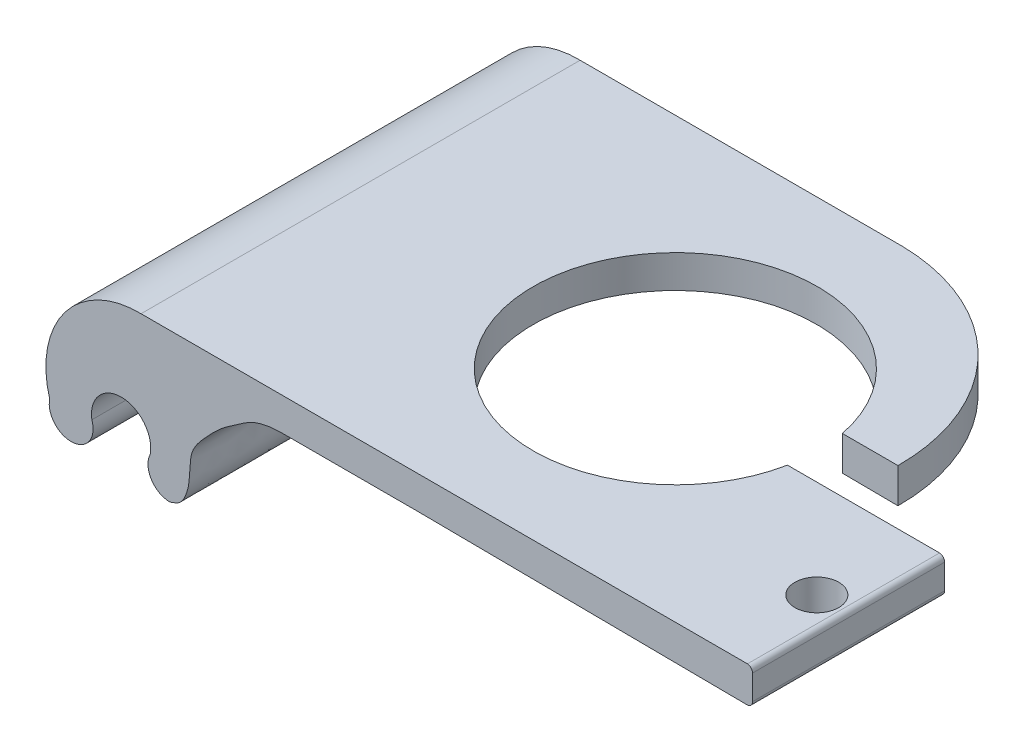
ISO-10303-21;
HEADER;
FILE_DESCRIPTION(('STEP AP214'),'2;1');
FILE_NAME('part.step','',(''),(''),'','','');
FILE_SCHEMA(('AUTOMOTIVE_DESIGN { 1 0 10303 214 1 1 1 1 }'));
ENDSEC;
DATA;
#1=APPLICATION_CONTEXT('core data for automotive mechanical design processes');
#2=APPLICATION_PROTOCOL_DEFINITION('international standard','automotive_design',2000,#1);
#3=PRODUCT_CONTEXT('',#1,'mechanical');
#4=PRODUCT('Part','Part','',(#3));
#5=PRODUCT_RELATED_PRODUCT_CATEGORY('part','',(#4));
#6=PRODUCT_DEFINITION_FORMATION('','',#4);
#7=PRODUCT_DEFINITION_CONTEXT('part definition',#1,'design');
#8=PRODUCT_DEFINITION('design','',#6,#7);
#9=PRODUCT_DEFINITION_SHAPE('','',#8);
#10=(LENGTH_UNIT() NAMED_UNIT(*) SI_UNIT(.MILLI.,.METRE.));
#11=(NAMED_UNIT(*) PLANE_ANGLE_UNIT() SI_UNIT($,.RADIAN.));
#12=(NAMED_UNIT(*) SI_UNIT($,.STERADIAN.) SOLID_ANGLE_UNIT());
#13=UNCERTAINTY_MEASURE_WITH_UNIT(LENGTH_MEASURE(1.E-05),#10,'distance_accuracy_value','');
#14=(GEOMETRIC_REPRESENTATION_CONTEXT(3) GLOBAL_UNCERTAINTY_ASSIGNED_CONTEXT((#13)) GLOBAL_UNIT_ASSIGNED_CONTEXT((#10,
#11,#12)) REPRESENTATION_CONTEXT('',''));
#15=CARTESIAN_POINT('',(0.,0.,0.));
#16=DIRECTION('',(0.,0.,1.));
#17=DIRECTION('',(1.,0.,0.));
#18=AXIS2_PLACEMENT_3D('',#15,#16,#17);
#19=CARTESIAN_POINT('',(0.0888975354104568,10.2380328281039,40.));
#20=DIRECTION('',(0.00868274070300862,0.999962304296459,0.));
#21=DIRECTION('',(-0.999962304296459,0.00868274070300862,0.));
#22=AXIS2_PLACEMENT_3D('',#19,#20,#21);
#23=PLANE('',#22);
#24=DIRECTION('',(-0.999962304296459,0.00868274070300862,0.));
#25=VECTOR('',#24,1.);
#26=CARTESIAN_POINT('',(0.088897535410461,10.2380328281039,22.5));
#27=LINE('',#26,#25);
#28=CARTESIAN_POINT('',(-3.01206423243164,10.2649586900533,22.5));
#29=VERTEX_POINT('',#28);
#30=CARTESIAN_POINT('',(-16.8254071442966,10.3849008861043,22.5));
#31=VERTEX_POINT('',#30);
#32=EDGE_CURVE('E211',#29,#31,#27,.T.);
#33=ORIENTED_EDGE('',*,*,#32,.F.);
#34=DIRECTION('',(0.,0.,-1.));
#35=VECTOR('',#34,1.);
#36=CARTESIAN_POINT('',(-3.01206423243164,10.2649586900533,40.));
#37=LINE('',#36,#35);
#38=CARTESIAN_POINT('',(-3.01206423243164,10.2649586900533,40.));
#39=VERTEX_POINT('',#38);
#40=EDGE_CURVE('E259',#39,#29,#37,.T.);
#41=ORIENTED_EDGE('',*,*,#40,.F.);
#42=DIRECTION('',(0.999962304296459,-0.00868274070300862,0.));
#43=VECTOR('',#42,1.);
#44=CARTESIAN_POINT('',(0.0888975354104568,10.2380328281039,40.));
#45=LINE('',#44,#43);
#46=CARTESIAN_POINT('',(-33.0311512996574,10.5256164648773,40.));
#47=VERTEX_POINT('',#46);
#48=EDGE_CURVE('E225',#47,#39,#45,.T.);
#49=ORIENTED_EDGE('',*,*,#48,.F.);
#50=DIRECTION('',(0.,0.,-1.));
#51=VECTOR('',#50,1.);
#52=CARTESIAN_POINT('',(-33.0311512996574,10.5256164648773,40.));
#53=LINE('',#52,#51);
#54=CARTESIAN_POINT('',(-33.0311512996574,10.5256164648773,32.4779193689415));
#55=VERTEX_POINT('',#54);
#56=EDGE_CURVE('E49',#47,#55,#53,.T.);
#57=ORIENTED_EDGE('',*,*,#56,.T.);
#58=CARTESIAN_POINT('',(-29.539251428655,10.4952960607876,20.));
#59=DIRECTION('',(0.00868274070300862,0.999962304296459,0.));
#60=DIRECTION('',(-0.999962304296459,0.00868274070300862,0.));
#61=AXIS2_PLACEMENT_3D('',#58,#59,#60);
#62=ELLIPSE('',#61,12.9577966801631,12.9573082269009);
#63=EDGE_CURVE('E442',#31,#55,#62,.F.);
#64=ORIENTED_EDGE('',*,*,#63,.F.);
#65=EDGE_LOOP('',(#33,#41,#49,#57,#64));
#66=FACE_BOUND('',#65,.T.);
#67=CARTESIAN_POINT('',(-5.24765579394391,10.284370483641,31.4026384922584));
#68=DIRECTION('',(0.00868274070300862,0.999962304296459,0.));
#69=DIRECTION('',(-0.999962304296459,0.00868274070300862,0.));
#70=AXIS2_PLACEMENT_3D('',#67,#68,#69);
#71=ELLIPSE('',#70,2.00007539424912,2.);
#72=CARTESIAN_POINT('',(-7.24765579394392,10.3017366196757,31.4026384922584));
#73=VERTEX_POINT('',#72);
#74=EDGE_CURVE('E215',#73,#73,#71,.F.);
#75=ORIENTED_EDGE('',*,*,#74,.F.);
#76=EDGE_LOOP('',(#75));
#77=FACE_BOUND('',#76,.T.);
#78=ADVANCED_FACE('F41',(#66,#77),#23,.F.);
#79=CARTESIAN_POINT('',(-33.0311512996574,10.5256164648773,7.52208063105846));
#80=VERTEX_POINT('',#79);
#81=CARTESIAN_POINT('',(-16.8254071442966,10.3849008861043,17.5));
#82=VERTEX_POINT('',#81);
#83=EDGE_CURVE('E269',#80,#82,#62,.F.);
#84=ORIENTED_EDGE('',*,*,#83,.F.);
#85=CARTESIAN_POINT('',(-33.0311512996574,10.5256164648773,0.));
#86=VERTEX_POINT('',#85);
#87=EDGE_CURVE('E260',#80,#86,#53,.T.);
#88=ORIENTED_EDGE('',*,*,#87,.T.);
#89=DIRECTION('',(0.999962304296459,-0.00868274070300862,0.));
#90=VECTOR('',#89,1.);
#91=CARTESIAN_POINT('',(0.0888975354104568,10.2380328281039,0.));
#92=LINE('',#91,#90);
#93=CARTESIAN_POINT('',(-28.8114116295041,10.4889761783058,0.));
#94=VERTEX_POINT('',#93);
#95=EDGE_CURVE('E218',#86,#94,#92,.T.);
#96=ORIENTED_EDGE('',*,*,#95,.T.);
#97=CARTESIAN_POINT('',(-29.1753315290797,10.4921361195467,17.4149187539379));
#98=DIRECTION('',(0.00868274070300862,0.999962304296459,0.));
#99=DIRECTION('',(-0.999962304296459,0.00868274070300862,0.));
#100=AXIS2_PLACEMENT_3D('',#97,#98,#99);
#101=ELLIPSE('',#100,17.4193773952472,17.4187207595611);
#102=CARTESIAN_POINT('',(-11.7568185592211,10.340889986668,17.5));
#103=VERTEX_POINT('',#102);
#104=EDGE_CURVE('E55',#103,#94,#101,.T.);
#105=ORIENTED_EDGE('',*,*,#104,.F.);
#106=DIRECTION('',(0.999962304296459,-0.00868274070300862,0.));
#107=VECTOR('',#106,1.);
#108=CARTESIAN_POINT('',(0.0888975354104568,10.2380328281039,17.5));
#109=LINE('',#108,#107);
#110=EDGE_CURVE('E437',#82,#103,#109,.T.);
#111=ORIENTED_EDGE('',*,*,#110,.F.);
#112=EDGE_LOOP('',(#84,#88,#96,#105,#111));
#113=FACE_BOUND('',#112,.T.);
#114=ADVANCED_FACE('F197',(#113),#23,.F.);
#115=CARTESIAN_POINT('',(-3.00772286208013,10.7649398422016,40.));
#116=DIRECTION('',(0.,0.,-1.));
#117=DIRECTION('',(-1.,0.,0.));
#118=AXIS2_PLACEMENT_3D('',#115,#116,#117);
#119=CYLINDRICAL_SURFACE('',#118,0.500000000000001);
#120=CARTESIAN_POINT('',(-3.00772286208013,10.7649398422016,22.5));
#121=DIRECTION('',(0.,0.,-1.));
#122=DIRECTION('',(-1.,0.,0.));
#123=AXIS2_PLACEMENT_3D('',#120,#121,#122);
#124=CIRCLE('',#123,0.500000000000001);
#125=CARTESIAN_POINT('',(-2.50772286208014,10.7649398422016,22.5));
#126=VERTEX_POINT('',#125);
#127=EDGE_CURVE('E219',#126,#29,#124,.T.);
#128=ORIENTED_EDGE('',*,*,#127,.F.);
#129=DIRECTION('',(0.,0.,-1.));
#130=VECTOR('',#129,1.);
#131=CARTESIAN_POINT('',(-2.50772286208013,10.7649398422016,40.));
#132=LINE('',#131,#130);
#133=CARTESIAN_POINT('',(-2.50772286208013,10.7649398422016,40.));
#134=VERTEX_POINT('',#133);
#135=EDGE_CURVE('E256',#134,#126,#132,.T.);
#136=ORIENTED_EDGE('',*,*,#135,.F.);
#137=CARTESIAN_POINT('',(-3.00772286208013,10.7649398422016,40.));
#138=DIRECTION('',(0.,0.,1.));
#139=DIRECTION('',(1.,0.,0.));
#140=AXIS2_PLACEMENT_3D('',#137,#138,#139);
#141=CIRCLE('',#140,0.500000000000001);
#142=EDGE_CURVE('E228',#39,#134,#141,.T.);
#143=ORIENTED_EDGE('',*,*,#142,.F.);
#144=ORIENTED_EDGE('',*,*,#40,.T.);
#145=EDGE_LOOP('',(#128,#136,#143,#144));
#146=FACE_BOUND('',#145,.T.);
#147=ADVANCED_FACE('F194',(#146),#119,.T.);
#148=CARTESIAN_POINT('',(-2.50772286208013,0.,40.));
#149=DIRECTION('',(-1.,0.,0.));
#150=DIRECTION('',(0.,-1.,0.));
#151=AXIS2_PLACEMENT_3D('',#148,#149,#150);
#152=PLANE('',#151);
#153=DIRECTION('',(0.,1.,0.));
#154=VECTOR('',#153,1.);
#155=CARTESIAN_POINT('',(-2.50772286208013,-0.0256278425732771,22.5));
#156=LINE('',#155,#154);
#157=CARTESIAN_POINT('',(-2.50772286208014,13.0197637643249,22.5));
#158=VERTEX_POINT('',#157);
#159=EDGE_CURVE('E433',#126,#158,#156,.T.);
#160=ORIENTED_EDGE('',*,*,#159,.T.);
#161=DIRECTION('',(0.,0.,-1.));
#162=VECTOR('',#161,1.);
#163=CARTESIAN_POINT('',(-2.50772286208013,13.0197637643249,40.));
#164=LINE('',#163,#162);
#165=CARTESIAN_POINT('',(-2.50772286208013,13.0197637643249,40.));
#166=VERTEX_POINT('',#165);
#167=EDGE_CURVE('E253',#166,#158,#164,.T.);
#168=ORIENTED_EDGE('',*,*,#167,.F.);
#169=DIRECTION('',(0.,1.,0.));
#170=VECTOR('',#169,1.);
#171=CARTESIAN_POINT('',(-2.50772286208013,0.,40.));
#172=LINE('',#171,#170);
#173=EDGE_CURVE('E230',#134,#166,#172,.T.);
#174=ORIENTED_EDGE('',*,*,#173,.F.);
#175=ORIENTED_EDGE('',*,*,#135,.T.);
#176=EDGE_LOOP('',(#160,#168,#174,#175));
#177=FACE_BOUND('',#176,.T.);
#178=ADVANCED_FACE('F190',(#177),#152,.F.);
#179=CARTESIAN_POINT('',(-3.00772286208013,13.0197637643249,40.));
#180=DIRECTION('',(0.,0.,-1.));
#181=DIRECTION('',(-1.,0.,0.));
#182=AXIS2_PLACEMENT_3D('',#179,#180,#181);
#183=CYLINDRICAL_SURFACE('',#182,0.5);
#184=CARTESIAN_POINT('',(-3.00772286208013,13.0197637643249,22.5));
#185=DIRECTION('',(0.,0.,-1.));
#186=DIRECTION('',(-1.,0.,0.));
#187=AXIS2_PLACEMENT_3D('',#184,#185,#186);
#188=CIRCLE('',#187,0.5);
#189=CARTESIAN_POINT('',(-2.96749969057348,13.5181432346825,22.5));
#190=VERTEX_POINT('',#189);
#191=EDGE_CURVE('E444',#190,#158,#188,.T.);
#192=ORIENTED_EDGE('',*,*,#191,.F.);
#193=DIRECTION('',(0.,0.,-1.));
#194=VECTOR('',#193,1.);
#195=CARTESIAN_POINT('',(-2.96749969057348,13.5181432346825,40.));
#196=LINE('',#195,#194);
#197=CARTESIAN_POINT('',(-2.96749969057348,13.5181432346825,40.));
#198=VERTEX_POINT('',#197);
#199=EDGE_CURVE('E250',#198,#190,#196,.T.);
#200=ORIENTED_EDGE('',*,*,#199,.F.);
#201=CARTESIAN_POINT('',(-3.00772286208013,13.0197637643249,40.));
#202=DIRECTION('',(0.,0.,1.));
#203=DIRECTION('',(1.,0.,0.));
#204=AXIS2_PLACEMENT_3D('',#201,#202,#203);
#205=CIRCLE('',#204,0.5);
#206=EDGE_CURVE('E232',#166,#198,#205,.T.);
#207=ORIENTED_EDGE('',*,*,#206,.F.);
#208=ORIENTED_EDGE('',*,*,#167,.T.);
#209=EDGE_LOOP('',(#192,#200,#207,#208));
#210=FACE_BOUND('',#209,.T.);
#211=ADVANCED_FACE('F186',(#210),#183,.T.);
#212=CARTESIAN_POINT('',(0.,13.5181432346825,40.));
#213=DIRECTION('',(0.,1.,0.));
#214=DIRECTION('',(0.,0.,1.));
#215=AXIS2_PLACEMENT_3D('',#212,#213,#214);
#216=PLANE('',#215);
#217=ORIENTED_EDGE('',*,*,#199,.T.);
#218=DIRECTION('',(-1.,0.,0.));
#219=VECTOR('',#218,1.);
#220=CARTESIAN_POINT('',(-2.50772286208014,13.5181432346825,22.5));
#221=LINE('',#220,#219);
#222=CARTESIAN_POINT('',(-16.8254071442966,13.5181432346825,22.5));
#223=VERTEX_POINT('',#222);
#224=EDGE_CURVE('E410',#190,#223,#221,.T.);
#225=ORIENTED_EDGE('',*,*,#224,.T.);
#226=CARTESIAN_POINT('',(-29.539251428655,13.5181432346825,20.));
#227=DIRECTION('',(0.,-1.,0.));
#228=DIRECTION('',(1.,0.,0.));
#229=AXIS2_PLACEMENT_3D('',#226,#227,#228);
#230=CIRCLE('',#229,12.9573082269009);
#231=CARTESIAN_POINT('',(-16.8254071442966,13.5181432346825,17.5));
#232=VERTEX_POINT('',#231);
#233=EDGE_CURVE('E413',#223,#232,#230,.T.);
#234=ORIENTED_EDGE('',*,*,#233,.T.);
#235=DIRECTION('',(1.,0.,0.));
#236=VECTOR('',#235,1.);
#237=CARTESIAN_POINT('',(-11.7568185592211,13.5181432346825,17.5));
#238=LINE('',#237,#236);
#239=CARTESIAN_POINT('',(-11.7568185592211,13.5181432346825,17.5));
#240=VERTEX_POINT('',#239);
#241=EDGE_CURVE('E418',#232,#240,#238,.T.);
#242=ORIENTED_EDGE('',*,*,#241,.T.);
#243=CARTESIAN_POINT('',(-29.1753315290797,13.5181432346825,17.4149187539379));
#244=DIRECTION('',(0.,1.,0.));
#245=DIRECTION('',(-1.,0.,0.));
#246=AXIS2_PLACEMENT_3D('',#243,#244,#245);
#247=CIRCLE('',#246,17.4187207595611);
#248=CARTESIAN_POINT('',(-28.8114116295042,13.5181432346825,0.));
#249=VERTEX_POINT('',#248);
#250=EDGE_CURVE('E421',#240,#249,#247,.T.);
#251=ORIENTED_EDGE('',*,*,#250,.T.);
#252=DIRECTION('',(1.,0.,0.));
#253=VECTOR('',#252,1.);
#254=CARTESIAN_POINT('',(0.,13.5181432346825,0.));
#255=LINE('',#254,#253);
#256=CARTESIAN_POINT('',(-58.2152992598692,13.5181432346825,0.));
#257=VERTEX_POINT('',#256);
#258=EDGE_CURVE('E273',#257,#249,#255,.T.);
#259=ORIENTED_EDGE('',*,*,#258,.F.);
#260=DIRECTION('',(0.,0.,-1.));
#261=VECTOR('',#260,1.);
#262=CARTESIAN_POINT('',(-58.2152992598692,13.5181432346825,40.));
#263=LINE('',#262,#261);
#264=CARTESIAN_POINT('',(-58.2152992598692,13.5181432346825,40.));
#265=VERTEX_POINT('',#264);
#266=EDGE_CURVE('E245',#265,#257,#263,.T.);
#267=ORIENTED_EDGE('',*,*,#266,.F.);
#268=DIRECTION('',(1.,0.,0.));
#269=VECTOR('',#268,1.);
#270=CARTESIAN_POINT('',(0.,13.5181432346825,40.));
#271=LINE('',#270,#269);
#272=EDGE_CURVE('E234',#265,#198,#271,.T.);
#273=ORIENTED_EDGE('',*,*,#272,.T.);
#274=EDGE_LOOP('',(#217,#225,#234,#242,#251,#259,#267,#273));
#275=FACE_BOUND('',#274,.T.);
#276=CARTESIAN_POINT('',(-5.24765579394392,13.5181432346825,31.4026384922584));
#277=DIRECTION('',(0.,-1.,0.));
#278=DIRECTION('',(1.,0.,0.));
#279=AXIS2_PLACEMENT_3D('',#276,#277,#278);
#280=CIRCLE('',#279,2.);
#281=CARTESIAN_POINT('',(-3.24765579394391,13.5181432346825,31.4026384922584));
#282=VERTEX_POINT('',#281);
#283=EDGE_CURVE('E408',#282,#282,#280,.T.);
#284=ORIENTED_EDGE('',*,*,#283,.T.);
#285=EDGE_LOOP('',(#284));
#286=FACE_BOUND('',#285,.T.);
#287=ADVANCED_FACE('F183',(#275,#286),#216,.T.);
#288=CARTESIAN_POINT('',(0.,0.,0.));
#289=DIRECTION('',(0.,0.,1.));
#290=DIRECTION('',(1.,0.,0.));
#291=AXIS2_PLACEMENT_3D('',#288,#289,#290);
#292=PLANE('',#291);
#293=DIRECTION('',(0.,1.,0.));
#294=VECTOR('',#293,1.);
#295=CARTESIAN_POINT('',(-28.8114116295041,-0.0256278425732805,0.));
#296=LINE('',#295,#294);
#297=EDGE_CURVE('E11',#94,#249,#296,.T.);
#298=ORIENTED_EDGE('',*,*,#297,.F.);
#299=ORIENTED_EDGE('',*,*,#95,.F.);
#300=DIRECTION('',(-1.,0.,0.));
#301=VECTOR('',#300,1.);
#302=CARTESIAN_POINT('',(0.,10.5256164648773,0.));
#303=LINE('',#302,#301);
#304=CARTESIAN_POINT('',(-45.539251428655,10.5256164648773,0.));
#305=VERTEX_POINT('',#304);
#306=EDGE_CURVE('E159',#86,#305,#303,.T.);
#307=ORIENTED_EDGE('',*,*,#306,.T.);
#308=CARTESIAN_POINT('',(-45.539251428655,10.5256164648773,0.));
#309=CARTESIAN_POINT('',(-47.7252593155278,10.4455169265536,0.));
#310=CARTESIAN_POINT('',(-48.5395845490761,9.77673156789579,0.));
#311=CARTESIAN_POINT('',(-50.7750043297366,8.25353149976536,0.));
#312=CARTESIAN_POINT('',(-51.4352016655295,7.72180048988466,0.));
#313=CARTESIAN_POINT('',(-53.5464931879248,5.32378377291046,0.));
#314=CARTESIAN_POINT('',(-53.7615968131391,4.19392493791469,0.));
#315=CARTESIAN_POINT('',(-53.8025920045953,2.53974641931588,0.));
#316=CARTESIAN_POINT('',(-53.9993546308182,1.58296218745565,0.));
#317=CARTESIAN_POINT('',(-54.448557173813,0.282260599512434,0.));
#318=CARTESIAN_POINT('',(-55.326894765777,0.0716972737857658,0.));
#319=CARTESIAN_POINT('',(-55.5748993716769,-0.0256137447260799,0.));
#320=B_SPLINE_CURVE_WITH_KNOTS('',3,(#308,#309,#310,#311,#312,#313,#314,#315,#316,#317,#318,
#319),.UNSPECIFIED.,.F.,.F.,(4,1,1,1,1,1,1,1,1,4),(0.,0.263204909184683,0.312704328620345,
0.474739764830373,0.506949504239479,0.614547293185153,0.712668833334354,0.731664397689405,
0.804502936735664,0.864132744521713),.UNSPECIFIED.);
#321=CARTESIAN_POINT('',(-55.5748993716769,-0.0256137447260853,0.));
#322=VERTEX_POINT('',#321);
#323=EDGE_CURVE('E226',#305,#322,#320,.T.);
#324=ORIENTED_EDGE('',*,*,#323,.T.);
#325=CARTESIAN_POINT('',(-55.5824087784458,1.97437215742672,0.));
#326=DIRECTION('',(0.,0.,1.));
#327=DIRECTION('',(1.,0.,0.));
#328=AXIS2_PLACEMENT_3D('',#325,#326,#327);
#329=CIRCLE('',#328,2.);
#330=CARTESIAN_POINT('',(-57.3736996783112,2.86390962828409,0.));
#331=VERTEX_POINT('',#330);
#332=EDGE_CURVE('E462',#322,#331,#329,.F.);
#333=ORIENTED_EDGE('',*,*,#332,.T.);
#334=CARTESIAN_POINT('',(-60.0311512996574,3.34135164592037,0.));
#335=DIRECTION('',(0.,0.,1.));
#336=DIRECTION('',(1.,0.,0.));
#337=AXIS2_PLACEMENT_3D('',#334,#335,#336);
#338=CIRCLE('',#337,2.7);
#339=CARTESIAN_POINT('',(-62.6962085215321,2.90837358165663,0.));
#340=VERTEX_POINT('',#339);
#341=EDGE_CURVE('E131',#331,#340,#338,.T.);
#342=ORIENTED_EDGE('',*,*,#341,.T.);
#343=CARTESIAN_POINT('',(-64.5824087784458,2.24335584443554,0.));
#344=DIRECTION('',(0.,0.,1.));
#345=DIRECTION('',(1.,0.,0.));
#346=AXIS2_PLACEMENT_3D('',#343,#344,#345);
#347=CIRCLE('',#346,2.);
#348=CARTESIAN_POINT('',(-66.5439360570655,2.63375401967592,0.));
#349=VERTEX_POINT('',#348);
#350=EDGE_CURVE('E243',#340,#349,#347,.F.);
#351=ORIENTED_EDGE('',*,*,#350,.T.);
#352=CARTESIAN_POINT('',(-58.3857170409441,5.01985177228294,0.));
#353=DIRECTION('',(0.,0.,1.));
#354=DIRECTION('',(1.,0.,0.));
#355=AXIS2_PLACEMENT_3D('',#352,#353,#354);
#356=CIRCLE('',#355,8.5);
#357=EDGE_CURVE('E474',#349,#257,#356,.F.);
#358=ORIENTED_EDGE('',*,*,#357,.T.);
#359=ORIENTED_EDGE('',*,*,#258,.T.);
#360=EDGE_LOOP('',(#298,#299,#307,#324,#333,#342,#351,#358,#359));
#361=FACE_BOUND('',#360,.T.);
#362=ADVANCED_FACE('F169',(#361),#292,.F.);
#363=CARTESIAN_POINT('',(0.,10.5256164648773,40.));
#364=DIRECTION('',(0.,-1.,0.));
#365=DIRECTION('',(1.,0.,0.));
#366=AXIS2_PLACEMENT_3D('',#363,#364,#365);
#367=PLANE('',#366);
#368=ORIENTED_EDGE('',*,*,#87,.F.);
#369=CARTESIAN_POINT('',(-29.539251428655,10.5256164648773,20.));
#370=DIRECTION('',(0.,-1.,0.));
#371=DIRECTION('',(1.,0.,0.));
#372=AXIS2_PLACEMENT_3D('',#369,#370,#371);
#373=CIRCLE('',#372,12.9573082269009);
#374=EDGE_CURVE('E441',#80,#55,#373,.F.);
#375=ORIENTED_EDGE('',*,*,#374,.T.);
#376=ORIENTED_EDGE('',*,*,#56,.F.);
#377=DIRECTION('',(-1.,0.,0.));
#378=VECTOR('',#377,1.);
#379=CARTESIAN_POINT('',(0.,10.5256164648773,40.));
#380=LINE('',#379,#378);
#381=CARTESIAN_POINT('',(-45.539251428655,10.5256164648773,40.));
#382=VERTEX_POINT('',#381);
#383=EDGE_CURVE('E223',#47,#382,#380,.T.);
#384=ORIENTED_EDGE('',*,*,#383,.T.);
#385=DIRECTION('',(0.,0.,-1.));
#386=VECTOR('',#385,1.);
#387=CARTESIAN_POINT('',(-45.539251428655,10.5256164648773,40.));
#388=LINE('',#387,#386);
#389=EDGE_CURVE('E64',#382,#305,#388,.T.);
#390=ORIENTED_EDGE('',*,*,#389,.T.);
#391=ORIENTED_EDGE('',*,*,#306,.F.);
#392=EDGE_LOOP('',(#368,#375,#376,#384,#390,#391));
#393=FACE_BOUND('',#392,.T.);
#394=ADVANCED_FACE('F43',(#393),#367,.T.);
#395=CARTESIAN_POINT('',(-58.3857170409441,5.01985177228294,40.));
#396=DIRECTION('',(0.,0.,-1.));
#397=DIRECTION('',(-1.,0.,0.));
#398=AXIS2_PLACEMENT_3D('',#395,#396,#397);
#399=CYLINDRICAL_SURFACE('',#398,8.5);
#400=ORIENTED_EDGE('',*,*,#357,.F.);
#401=DIRECTION('',(0.,0.,-1.));
#402=VECTOR('',#401,1.);
#403=CARTESIAN_POINT('',(-66.5439360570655,2.63375401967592,40.));
#404=LINE('',#403,#402);
#405=CARTESIAN_POINT('',(-66.5439360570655,2.63375401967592,40.));
#406=VERTEX_POINT('',#405);
#407=EDGE_CURVE('E240',#406,#349,#404,.T.);
#408=ORIENTED_EDGE('',*,*,#407,.F.);
#409=CARTESIAN_POINT('',(-58.3857170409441,5.01985177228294,40.));
#410=DIRECTION('',(0.,0.,1.));
#411=DIRECTION('',(1.,0.,0.));
#412=AXIS2_PLACEMENT_3D('',#409,#410,#411);
#413=CIRCLE('',#412,8.5);
#414=EDGE_CURVE('E237',#406,#265,#413,.F.);
#415=ORIENTED_EDGE('',*,*,#414,.T.);
#416=ORIENTED_EDGE('',*,*,#266,.T.);
#417=EDGE_LOOP('',(#400,#408,#415,#416));
#418=FACE_BOUND('',#417,.T.);
#419=ADVANCED_FACE('F178',(#418),#399,.T.);
#420=CARTESIAN_POINT('',(-64.5824087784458,2.24335584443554,40.));
#421=DIRECTION('',(0.,0.,-1.));
#422=DIRECTION('',(-1.,0.,0.));
#423=AXIS2_PLACEMENT_3D('',#420,#421,#422);
#424=CYLINDRICAL_SURFACE('',#423,2.);
#425=ORIENTED_EDGE('',*,*,#350,.F.);
#426=DIRECTION('',(0.,0.,-1.));
#427=VECTOR('',#426,1.);
#428=CARTESIAN_POINT('',(-62.6962085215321,2.90837358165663,40.));
#429=LINE('',#428,#427);
#430=CARTESIAN_POINT('',(-62.6962085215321,2.90837358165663,40.));
#431=VERTEX_POINT('',#430);
#432=EDGE_CURVE('E136',#431,#340,#429,.T.);
#433=ORIENTED_EDGE('',*,*,#432,.F.);
#434=CARTESIAN_POINT('',(-64.5824087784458,2.24335584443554,40.));
#435=DIRECTION('',(0.,0.,1.));
#436=DIRECTION('',(1.,0.,0.));
#437=AXIS2_PLACEMENT_3D('',#434,#435,#436);
#438=CIRCLE('',#437,2.);
#439=EDGE_CURVE('E148',#431,#406,#438,.F.);
#440=ORIENTED_EDGE('',*,*,#439,.T.);
#441=ORIENTED_EDGE('',*,*,#407,.T.);
#442=EDGE_LOOP('',(#425,#433,#440,#441));
#443=FACE_BOUND('',#442,.T.);
#444=ADVANCED_FACE('F175',(#443),#424,.T.);
#445=CARTESIAN_POINT('',(-60.0311512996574,3.34135164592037,40.));
#446=DIRECTION('',(0.,0.,-1.));
#447=DIRECTION('',(-1.,0.,0.));
#448=AXIS2_PLACEMENT_3D('',#445,#446,#447);
#449=CYLINDRICAL_SURFACE('',#448,2.7);
#450=ORIENTED_EDGE('',*,*,#341,.F.);
#451=DIRECTION('',(0.,0.,-1.));
#452=VECTOR('',#451,1.);
#453=CARTESIAN_POINT('',(-57.3736996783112,2.86390962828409,40.));
#454=LINE('',#453,#452);
#455=CARTESIAN_POINT('',(-57.3736996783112,2.86390962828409,40.));
#456=VERTEX_POINT('',#455);
#457=EDGE_CURVE('E126',#456,#331,#454,.T.);
#458=ORIENTED_EDGE('',*,*,#457,.F.);
#459=CARTESIAN_POINT('',(-60.0311512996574,3.34135164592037,40.));
#460=DIRECTION('',(0.,0.,1.));
#461=DIRECTION('',(1.,0.,0.));
#462=AXIS2_PLACEMENT_3D('',#459,#460,#461);
#463=CIRCLE('',#462,2.7);
#464=EDGE_CURVE('E129',#456,#431,#463,.T.);
#465=ORIENTED_EDGE('',*,*,#464,.T.);
#466=ORIENTED_EDGE('',*,*,#432,.T.);
#467=EDGE_LOOP('',(#450,#458,#465,#466));
#468=FACE_BOUND('',#467,.T.);
#469=ADVANCED_FACE('F128',(#468),#449,.F.);
#470=CARTESIAN_POINT('',(-55.5824087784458,1.97437215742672,40.));
#471=DIRECTION('',(0.,0.,-1.));
#472=DIRECTION('',(-1.,0.,0.));
#473=AXIS2_PLACEMENT_3D('',#470,#471,#472);
#474=CYLINDRICAL_SURFACE('',#473,2.);
#475=ORIENTED_EDGE('',*,*,#332,.F.);
#476=DIRECTION('',(0.,0.,-1.));
#477=VECTOR('',#476,1.);
#478=CARTESIAN_POINT('',(-55.5748993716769,-0.0256137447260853,40.));
#479=LINE('',#478,#477);
#480=CARTESIAN_POINT('',(-55.5748993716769,-0.0256137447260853,40.));
#481=VERTEX_POINT('',#480);
#482=EDGE_CURVE('E137',#481,#322,#479,.T.);
#483=ORIENTED_EDGE('',*,*,#482,.F.);
#484=CARTESIAN_POINT('',(-55.5824087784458,1.97437215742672,40.));
#485=DIRECTION('',(0.,0.,1.));
#486=DIRECTION('',(1.,0.,0.));
#487=AXIS2_PLACEMENT_3D('',#484,#485,#486);
#488=CIRCLE('',#487,2.);
#489=EDGE_CURVE('E145',#481,#456,#488,.F.);
#490=ORIENTED_EDGE('',*,*,#489,.T.);
#491=ORIENTED_EDGE('',*,*,#457,.T.);
#492=EDGE_LOOP('',(#475,#483,#490,#491));
#493=FACE_BOUND('',#492,.T.);
#494=ADVANCED_FACE('F150',(#493),#474,.T.);
#495=CARTESIAN_POINT('',(-45.539251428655,10.5256164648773,40.));
#496=CARTESIAN_POINT('',(-47.7252593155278,10.4455169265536,40.));
#497=CARTESIAN_POINT('',(-48.5395845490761,9.77673156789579,40.));
#498=CARTESIAN_POINT('',(-50.7750043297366,8.25353149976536,40.));
#499=CARTESIAN_POINT('',(-51.4352016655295,7.72180048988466,40.));
#500=CARTESIAN_POINT('',(-53.5464931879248,5.32378377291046,40.));
#501=CARTESIAN_POINT('',(-53.7615968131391,4.19392493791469,40.));
#502=CARTESIAN_POINT('',(-53.8025920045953,2.53974641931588,40.));
#503=CARTESIAN_POINT('',(-53.9993546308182,1.58296218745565,40.));
#504=CARTESIAN_POINT('',(-54.448557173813,0.282260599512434,40.));
#505=CARTESIAN_POINT('',(-55.326894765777,0.0716972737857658,40.));
#506=CARTESIAN_POINT('',(-55.5748993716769,-0.0256137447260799,40.));
#507=B_SPLINE_CURVE_WITH_KNOTS('',3,(#495,#496,#497,#498,#499,#500,#501,#502,#503,#504,#505,
#506),.UNSPECIFIED.,.F.,.F.,(4,1,1,1,1,1,1,1,1,4),(0.,0.263204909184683,0.312704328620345,
0.474739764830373,0.506949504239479,0.614547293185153,0.712668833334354,0.731664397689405,
0.804502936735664,0.864132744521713),.UNSPECIFIED.);
#508=DIRECTION('',(0.,0.,-1.));
#509=VECTOR('',#508,1.);
#510=SURFACE_OF_LINEAR_EXTRUSION('',#507,#509);
#511=ORIENTED_EDGE('',*,*,#323,.F.);
#512=ORIENTED_EDGE('',*,*,#389,.F.);
#513=EDGE_CURVE('E151',#382,#481,#507,.T.);
#514=ORIENTED_EDGE('',*,*,#513,.T.);
#515=ORIENTED_EDGE('',*,*,#482,.T.);
#516=EDGE_LOOP('',(#511,#512,#514,#515));
#517=FACE_BOUND('',#516,.T.);
#518=ADVANCED_FACE('F165',(#517),#510,.T.);
#519=CARTESIAN_POINT('',(0.,0.,40.));
#520=DIRECTION('',(0.,0.,1.));
#521=DIRECTION('',(1.,0.,0.));
#522=AXIS2_PLACEMENT_3D('',#519,#520,#521);
#523=PLANE('',#522);
#524=ORIENTED_EDGE('',*,*,#383,.F.);
#525=ORIENTED_EDGE('',*,*,#48,.T.);
#526=ORIENTED_EDGE('',*,*,#142,.T.);
#527=ORIENTED_EDGE('',*,*,#173,.T.);
#528=ORIENTED_EDGE('',*,*,#206,.T.);
#529=ORIENTED_EDGE('',*,*,#272,.F.);
#530=ORIENTED_EDGE('',*,*,#414,.F.);
#531=ORIENTED_EDGE('',*,*,#439,.F.);
#532=ORIENTED_EDGE('',*,*,#464,.F.);
#533=ORIENTED_EDGE('',*,*,#489,.F.);
#534=ORIENTED_EDGE('',*,*,#513,.F.);
#535=EDGE_LOOP('',(#524,#525,#526,#527,#528,#529,#530,#531,#532,#533,#534));
#536=FACE_BOUND('',#535,.T.);
#537=ADVANCED_FACE('F143',(#536),#523,.T.);
#538=CARTESIAN_POINT('',(-2.50772286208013,-0.0256278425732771,22.5));
#539=DIRECTION('',(0.,0.,-1.));
#540=DIRECTION('',(-1.,0.,0.));
#541=AXIS2_PLACEMENT_3D('',#538,#539,#540);
#542=PLANE('',#541);
#543=ORIENTED_EDGE('',*,*,#32,.T.);
#544=DIRECTION('',(0.,1.,0.));
#545=VECTOR('',#544,1.);
#546=CARTESIAN_POINT('',(-16.8254071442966,-0.0256278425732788,22.5));
#547=LINE('',#546,#545);
#548=EDGE_CURVE('E430',#31,#223,#547,.T.);
#549=ORIENTED_EDGE('',*,*,#548,.T.);
#550=ORIENTED_EDGE('',*,*,#224,.F.);
#551=ORIENTED_EDGE('',*,*,#191,.T.);
#552=ORIENTED_EDGE('',*,*,#159,.F.);
#553=ORIENTED_EDGE('',*,*,#127,.T.);
#554=EDGE_LOOP('',(#543,#549,#550,#551,#552,#553));
#555=FACE_BOUND('',#554,.T.);
#556=ADVANCED_FACE('F313',(#555),#542,.T.);
#557=CARTESIAN_POINT('',(-29.539251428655,-0.0256278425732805,20.));
#558=DIRECTION('',(0.,1.,0.));
#559=DIRECTION('',(-1.,0.,0.));
#560=AXIS2_PLACEMENT_3D('',#557,#558,#559);
#561=CYLINDRICAL_SURFACE('',#560,12.9573082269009);
#562=ORIENTED_EDGE('',*,*,#63,.T.);
#563=ORIENTED_EDGE('',*,*,#374,.F.);
#564=ORIENTED_EDGE('',*,*,#83,.T.);
#565=DIRECTION('',(0.,1.,0.));
#566=VECTOR('',#565,1.);
#567=CARTESIAN_POINT('',(-16.8254071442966,-0.0256278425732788,17.5));
#568=LINE('',#567,#566);
#569=EDGE_CURVE('E427',#82,#232,#568,.T.);
#570=ORIENTED_EDGE('',*,*,#569,.T.);
#571=ORIENTED_EDGE('',*,*,#233,.F.);
#572=ORIENTED_EDGE('',*,*,#548,.F.);
#573=EDGE_LOOP('',(#562,#563,#564,#570,#571,#572));
#574=FACE_BOUND('',#573,.T.);
#575=ADVANCED_FACE('F316',(#574),#561,.F.);
#576=CARTESIAN_POINT('',(-11.7568185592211,-0.0256278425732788,17.5));
#577=DIRECTION('',(0.,0.,1.));
#578=DIRECTION('',(1.,0.,0.));
#579=AXIS2_PLACEMENT_3D('',#576,#577,#578);
#580=PLANE('',#579);
#581=ORIENTED_EDGE('',*,*,#110,.T.);
#582=DIRECTION('',(0.,1.,0.));
#583=VECTOR('',#582,1.);
#584=CARTESIAN_POINT('',(-11.7568185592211,-0.0256278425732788,17.5));
#585=LINE('',#584,#583);
#586=EDGE_CURVE('E424',#103,#240,#585,.T.);
#587=ORIENTED_EDGE('',*,*,#586,.T.);
#588=ORIENTED_EDGE('',*,*,#241,.F.);
#589=ORIENTED_EDGE('',*,*,#569,.F.);
#590=EDGE_LOOP('',(#581,#587,#588,#589));
#591=FACE_BOUND('',#590,.T.);
#592=ADVANCED_FACE('F325',(#591),#580,.T.);
#593=CARTESIAN_POINT('',(-29.1753315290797,-0.0256278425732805,17.4149187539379));
#594=DIRECTION('',(0.,1.,0.));
#595=DIRECTION('',(-1.,0.,0.));
#596=AXIS2_PLACEMENT_3D('',#593,#594,#595);
#597=CYLINDRICAL_SURFACE('',#596,17.4187207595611);
#598=ORIENTED_EDGE('',*,*,#104,.T.);
#599=ORIENTED_EDGE('',*,*,#297,.T.);
#600=ORIENTED_EDGE('',*,*,#250,.F.);
#601=ORIENTED_EDGE('',*,*,#586,.F.);
#602=EDGE_LOOP('',(#598,#599,#600,#601));
#603=FACE_BOUND('',#602,.T.);
#604=ADVANCED_FACE('F334',(#603),#597,.T.);
#605=CARTESIAN_POINT('',(-5.24765579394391,-0.0256278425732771,31.4026384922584));
#606=DIRECTION('',(0.,1.,0.));
#607=DIRECTION('',(-1.,0.,0.));
#608=AXIS2_PLACEMENT_3D('',#605,#606,#607);
#609=CYLINDRICAL_SURFACE('',#608,2.);
#610=ORIENTED_EDGE('',*,*,#283,.F.);
#611=EDGE_LOOP('',(#610));
#612=FACE_BOUND('',#611,.T.);
#613=ORIENTED_EDGE('',*,*,#74,.T.);
#614=EDGE_LOOP('',(#613));
#615=FACE_BOUND('',#614,.T.);
#616=ADVANCED_FACE('F343',(#612,#615),#609,.F.);
#617=CLOSED_SHELL('',(#78,#114,#147,#178,#211,#287,#362,#394,#419,#444,#469,#494,#518,#537,#556,
#575,#592,#604,#616));
#618=MANIFOLD_SOLID_BREP('B2',#617);
#619=ADVANCED_BREP_SHAPE_REPRESENTATION('',(#18,#618),#14);
#620=SHAPE_DEFINITION_REPRESENTATION(#9,#619);
ENDSEC;
END-ISO-10303-21;
